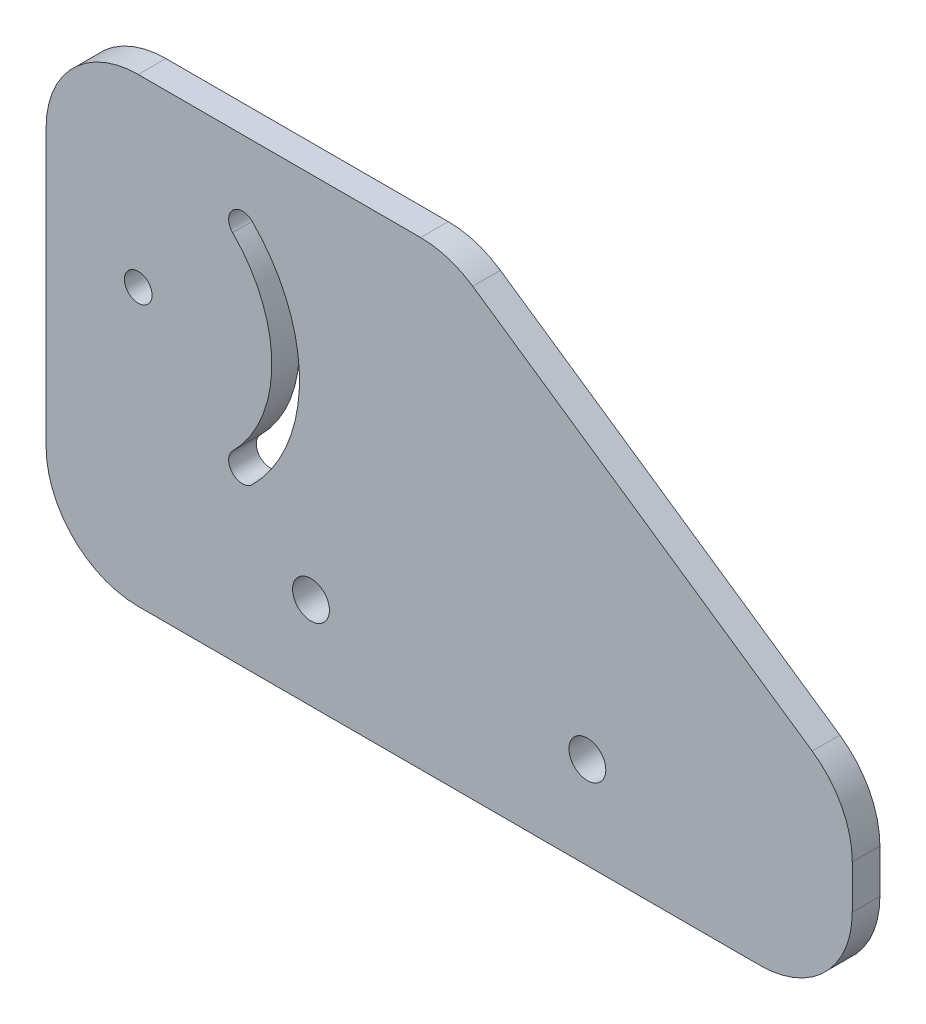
ISO-10303-21;
HEADER;
FILE_DESCRIPTION(('STEP AP214'),'2;1');
FILE_NAME('part.step','',(''),(''),'','','');
FILE_SCHEMA(('AUTOMOTIVE_DESIGN { 1 0 10303 214 1 1 1 1 }'));
ENDSEC;
DATA;
#1=APPLICATION_CONTEXT('core data for automotive mechanical design processes');
#2=APPLICATION_PROTOCOL_DEFINITION('international standard','automotive_design',2000,#1);
#3=PRODUCT_CONTEXT('',#1,'mechanical');
#4=PRODUCT('Part','Part','',(#3));
#5=PRODUCT_RELATED_PRODUCT_CATEGORY('part','',(#4));
#6=PRODUCT_DEFINITION_FORMATION('','',#4);
#7=PRODUCT_DEFINITION_CONTEXT('part definition',#1,'design');
#8=PRODUCT_DEFINITION('design','',#6,#7);
#9=PRODUCT_DEFINITION_SHAPE('','',#8);
#10=(LENGTH_UNIT() NAMED_UNIT(*) SI_UNIT(.MILLI.,.METRE.));
#11=(NAMED_UNIT(*) PLANE_ANGLE_UNIT() SI_UNIT($,.RADIAN.));
#12=(NAMED_UNIT(*) SI_UNIT($,.STERADIAN.) SOLID_ANGLE_UNIT());
#13=UNCERTAINTY_MEASURE_WITH_UNIT(LENGTH_MEASURE(1.E-05),#10,'distance_accuracy_value','');
#14=(GEOMETRIC_REPRESENTATION_CONTEXT(3) GLOBAL_UNCERTAINTY_ASSIGNED_CONTEXT((#13)) GLOBAL_UNIT_ASSIGNED_CONTEXT((#10,
#11,#12)) REPRESENTATION_CONTEXT('',''));
#15=CARTESIAN_POINT('',(0.,0.,0.));
#16=DIRECTION('',(0.,0.,1.));
#17=DIRECTION('',(1.,0.,0.));
#18=AXIS2_PLACEMENT_3D('',#15,#16,#17);
#19=CARTESIAN_POINT('',(43.75,25.,3.));
#20=DIRECTION('',(-1.,0.,0.));
#21=DIRECTION('',(0.,-1.,0.));
#22=AXIS2_PLACEMENT_3D('',#19,#20,#21);
#23=PLANE('',#22);
#24=DIRECTION('',(0.,1.,0.));
#25=VECTOR('',#24,1.);
#26=CARTESIAN_POINT('',(43.75,25.,0.));
#27=LINE('',#26,#25);
#28=CARTESIAN_POINT('',(43.75,-15.,0.));
#29=VERTEX_POINT('',#28);
#30=CARTESIAN_POINT('',(43.75,-10.2680543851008,0.));
#31=VERTEX_POINT('',#30);
#32=EDGE_CURVE('E191',#29,#31,#27,.T.);
#33=ORIENTED_EDGE('',*,*,#32,.T.);
#34=DIRECTION('',(0.,0.,1.));
#35=VECTOR('',#34,1.);
#36=CARTESIAN_POINT('',(43.75,-10.2680543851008,3.));
#37=LINE('',#36,#35);
#38=CARTESIAN_POINT('',(43.75,-10.2680543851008,3.));
#39=VERTEX_POINT('',#38);
#40=EDGE_CURVE('E258',#31,#39,#37,.T.);
#41=ORIENTED_EDGE('',*,*,#40,.T.);
#42=DIRECTION('',(0.,1.,0.));
#43=VECTOR('',#42,1.);
#44=CARTESIAN_POINT('',(43.75,25.,3.));
#45=LINE('',#44,#43);
#46=CARTESIAN_POINT('',(43.75,-15.,3.));
#47=VERTEX_POINT('',#46);
#48=EDGE_CURVE('E192',#47,#39,#45,.T.);
#49=ORIENTED_EDGE('',*,*,#48,.F.);
#50=DIRECTION('',(0.,0.,-1.));
#51=VECTOR('',#50,1.);
#52=CARTESIAN_POINT('',(43.75,-15.,3.));
#53=LINE('',#52,#51);
#54=EDGE_CURVE('E255',#47,#29,#53,.T.);
#55=ORIENTED_EDGE('',*,*,#54,.T.);
#56=EDGE_LOOP('',(#33,#41,#49,#55));
#57=FACE_BOUND('',#56,.T.);
#58=ADVANCED_FACE('F35',(#57),#23,.F.);
#59=CARTESIAN_POINT('',(-43.75,25.,3.));
#60=DIRECTION('',(0.,-1.,0.));
#61=DIRECTION('',(0.,0.,-1.));
#62=AXIS2_PLACEMENT_3D('',#59,#60,#61);
#63=PLANE('',#62);
#64=DIRECTION('',(-1.,0.,0.));
#65=VECTOR('',#64,1.);
#66=CARTESIAN_POINT('',(-43.75,25.,3.));
#67=LINE('',#66,#65);
#68=CARTESIAN_POINT('',(-3.09924597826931,25.,3.));
#69=VERTEX_POINT('',#68);
#70=CARTESIAN_POINT('',(-33.75,25.,3.));
#71=VERTEX_POINT('',#70);
#72=EDGE_CURVE('E195',#69,#71,#67,.T.);
#73=ORIENTED_EDGE('',*,*,#72,.F.);
#74=DIRECTION('',(0.,0.,1.));
#75=VECTOR('',#74,1.);
#76=CARTESIAN_POINT('',(-3.09924597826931,25.,3.));
#77=LINE('',#76,#75);
#78=CARTESIAN_POINT('',(-3.09924597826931,25.,0.));
#79=VERTEX_POINT('',#78);
#80=EDGE_CURVE('E245',#69,#79,#77,.F.);
#81=ORIENTED_EDGE('',*,*,#80,.T.);
#82=DIRECTION('',(-1.,0.,0.));
#83=VECTOR('',#82,1.);
#84=CARTESIAN_POINT('',(-43.75,25.,0.));
#85=LINE('',#84,#83);
#86=CARTESIAN_POINT('',(-33.75,25.,0.));
#87=VERTEX_POINT('',#86);
#88=EDGE_CURVE('E208',#79,#87,#85,.T.);
#89=ORIENTED_EDGE('',*,*,#88,.T.);
#90=DIRECTION('',(0.,0.,-1.));
#91=VECTOR('',#90,1.);
#92=CARTESIAN_POINT('',(-33.75,25.,3.));
#93=LINE('',#92,#91);
#94=EDGE_CURVE('E243',#87,#71,#93,.F.);
#95=ORIENTED_EDGE('',*,*,#94,.T.);
#96=EDGE_LOOP('',(#73,#81,#89,#95));
#97=FACE_BOUND('',#96,.T.);
#98=ADVANCED_FACE('F275',(#97),#63,.F.);
#99=CARTESIAN_POINT('',(-43.75,25.,3.));
#100=DIRECTION('',(1.,0.,0.));
#101=DIRECTION('',(0.,1.,0.));
#102=AXIS2_PLACEMENT_3D('',#99,#100,#101);
#103=PLANE('',#102);
#104=DIRECTION('',(0.,-1.,0.));
#105=VECTOR('',#104,1.);
#106=CARTESIAN_POINT('',(-43.75,25.,0.));
#107=LINE('',#106,#105);
#108=CARTESIAN_POINT('',(-43.75,15.,0.));
#109=VERTEX_POINT('',#108);
#110=CARTESIAN_POINT('',(-43.75,-15.,0.));
#111=VERTEX_POINT('',#110);
#112=EDGE_CURVE('E211',#109,#111,#107,.T.);
#113=ORIENTED_EDGE('',*,*,#112,.T.);
#114=DIRECTION('',(0.,0.,-1.));
#115=VECTOR('',#114,1.);
#116=CARTESIAN_POINT('',(-43.75,-15.,3.));
#117=LINE('',#116,#115);
#118=CARTESIAN_POINT('',(-43.75,-15.,3.));
#119=VERTEX_POINT('',#118);
#120=EDGE_CURVE('E11',#111,#119,#117,.F.);
#121=ORIENTED_EDGE('',*,*,#120,.T.);
#122=DIRECTION('',(0.,-1.,0.));
#123=VECTOR('',#122,1.);
#124=CARTESIAN_POINT('',(-43.75,25.,3.));
#125=LINE('',#124,#123);
#126=CARTESIAN_POINT('',(-43.75,15.,3.));
#127=VERTEX_POINT('',#126);
#128=EDGE_CURVE('E199',#127,#119,#125,.T.);
#129=ORIENTED_EDGE('',*,*,#128,.F.);
#130=DIRECTION('',(0.,0.,-1.));
#131=VECTOR('',#130,1.);
#132=CARTESIAN_POINT('',(-43.75,15.,3.));
#133=LINE('',#132,#131);
#134=EDGE_CURVE('E43',#127,#109,#133,.T.);
#135=ORIENTED_EDGE('',*,*,#134,.T.);
#136=EDGE_LOOP('',(#113,#121,#129,#135));
#137=FACE_BOUND('',#136,.T.);
#138=ADVANCED_FACE('F267',(#137),#103,.F.);
#139=CARTESIAN_POINT('',(-43.75,-25.,3.));
#140=DIRECTION('',(0.,1.,0.));
#141=DIRECTION('',(0.,0.,1.));
#142=AXIS2_PLACEMENT_3D('',#139,#140,#141);
#143=PLANE('',#142);
#144=DIRECTION('',(1.,0.,0.));
#145=VECTOR('',#144,1.);
#146=CARTESIAN_POINT('',(-43.75,-25.,0.));
#147=LINE('',#146,#145);
#148=CARTESIAN_POINT('',(-33.75,-25.,0.));
#149=VERTEX_POINT('',#148);
#150=CARTESIAN_POINT('',(33.75,-25.,0.));
#151=VERTEX_POINT('',#150);
#152=EDGE_CURVE('E196',#149,#151,#147,.T.);
#153=ORIENTED_EDGE('',*,*,#152,.T.);
#154=DIRECTION('',(0.,0.,-1.));
#155=VECTOR('',#154,1.);
#156=CARTESIAN_POINT('',(33.75,-25.,3.));
#157=LINE('',#156,#155);
#158=CARTESIAN_POINT('',(33.75,-25.,3.));
#159=VERTEX_POINT('',#158);
#160=EDGE_CURVE('E264',#151,#159,#157,.F.);
#161=ORIENTED_EDGE('',*,*,#160,.T.);
#162=DIRECTION('',(1.,0.,0.));
#163=VECTOR('',#162,1.);
#164=CARTESIAN_POINT('',(-43.75,-25.,3.));
#165=LINE('',#164,#163);
#166=CARTESIAN_POINT('',(-33.75,-25.,3.));
#167=VERTEX_POINT('',#166);
#168=EDGE_CURVE('E202',#167,#159,#165,.T.);
#169=ORIENTED_EDGE('',*,*,#168,.F.);
#170=DIRECTION('',(0.,0.,-1.));
#171=VECTOR('',#170,1.);
#172=CARTESIAN_POINT('',(-33.75,-25.,3.));
#173=LINE('',#172,#171);
#174=EDGE_CURVE('E261',#167,#149,#173,.T.);
#175=ORIENTED_EDGE('',*,*,#174,.T.);
#176=EDGE_LOOP('',(#153,#161,#169,#175));
#177=FACE_BOUND('',#176,.T.);
#178=ADVANCED_FACE('F301',(#177),#143,.F.);
#179=CARTESIAN_POINT('',(0.,0.,3.));
#180=DIRECTION('',(0.,0.,1.));
#181=DIRECTION('',(1.,0.,0.));
#182=AXIS2_PLACEMENT_3D('',#179,#180,#181);
#183=PLANE('',#182);
#184=CARTESIAN_POINT('',(-22.4362915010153,-6.31370849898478,3.));
#185=DIRECTION('',(0.,0.,1.));
#186=DIRECTION('',(1.,0.,0.));
#187=AXIS2_PLACEMENT_3D('',#184,#185,#186);
#188=CIRCLE('',#187,1.5);
#189=CARTESIAN_POINT('',(-23.4969516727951,-5.25304832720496,3.));
#190=VERTEX_POINT('',#189);
#191=CARTESIAN_POINT('',(-21.3756313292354,-7.3743686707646,3.));
#192=VERTEX_POINT('',#191);
#193=EDGE_CURVE('E158',#190,#192,#188,.T.);
#194=ORIENTED_EDGE('',*,*,#193,.F.);
#195=CARTESIAN_POINT('',(-33.75,5.,3.));
#196=DIRECTION('',(0.,0.,-1.));
#197=DIRECTION('',(1.,0.,0.));
#198=AXIS2_PLACEMENT_3D('',#195,#196,#197);
#199=CIRCLE('',#198,14.5);
#200=CARTESIAN_POINT('',(-23.4969516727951,15.2530483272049,3.));
#201=VERTEX_POINT('',#200);
#202=EDGE_CURVE('E163',#201,#190,#199,.T.);
#203=ORIENTED_EDGE('',*,*,#202,.F.);
#204=CARTESIAN_POINT('',(-22.4362915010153,16.3137084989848,3.));
#205=DIRECTION('',(0.,0.,1.));
#206=DIRECTION('',(1.,0.,0.));
#207=AXIS2_PLACEMENT_3D('',#204,#205,#206);
#208=CIRCLE('',#207,1.5);
#209=CARTESIAN_POINT('',(-21.3756313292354,17.3743686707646,3.));
#210=VERTEX_POINT('',#209);
#211=EDGE_CURVE('E142',#210,#201,#208,.T.);
#212=ORIENTED_EDGE('',*,*,#211,.F.);
#213=CARTESIAN_POINT('',(-33.75,5.,3.));
#214=DIRECTION('',(0.,0.,1.));
#215=DIRECTION('',(1.,0.,0.));
#216=AXIS2_PLACEMENT_3D('',#213,#214,#215);
#217=CIRCLE('',#216,17.5);
#218=EDGE_CURVE('E153',#192,#210,#217,.T.);
#219=ORIENTED_EDGE('',*,*,#218,.F.);
#220=EDGE_LOOP('',(#194,#203,#212,#219));
#221=FACE_BOUND('',#220,.T.);
#222=CARTESIAN_POINT('',(-33.75,5.,3.));
#223=DIRECTION('',(0.,0.,1.));
#224=DIRECTION('',(1.,0.,0.));
#225=AXIS2_PLACEMENT_3D('',#222,#223,#224);
#226=CIRCLE('',#225,1.5);
#227=CARTESIAN_POINT('',(-32.25,5.,3.));
#228=VERTEX_POINT('',#227);
#229=EDGE_CURVE('E170',#228,#228,#226,.T.);
#230=ORIENTED_EDGE('',*,*,#229,.F.);
#231=EDGE_LOOP('',(#230));
#232=FACE_BOUND('',#231,.T.);
#233=DIRECTION('',(0.824728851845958,-0.565528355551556,0.));
#234=VECTOR('',#233,1.);
#235=CARTESIAN_POINT('',(43.7499999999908,-4.99999999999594,3.));
#236=LINE('',#235,#234);
#237=CARTESIAN_POINT('',(2.55603757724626,23.2472885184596,3.));
#238=VERTEX_POINT('',#237);
#239=CARTESIAN_POINT('',(39.4052835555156,-2.02076586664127,3.));
#240=VERTEX_POINT('',#239);
#241=EDGE_CURVE('E176',#238,#240,#236,.T.);
#242=ORIENTED_EDGE('',*,*,#241,.F.);
#243=CARTESIAN_POINT('',(-3.09924597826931,15.,3.));
#244=DIRECTION('',(0.,0.,1.));
#245=DIRECTION('',(1.,0.,0.));
#246=AXIS2_PLACEMENT_3D('',#243,#244,#245);
#247=CIRCLE('',#246,10.);
#248=EDGE_CURVE('E241',#238,#69,#247,.T.);
#249=ORIENTED_EDGE('',*,*,#248,.T.);
#250=ORIENTED_EDGE('',*,*,#72,.T.);
#251=CARTESIAN_POINT('',(-33.75,15.,3.));
#252=DIRECTION('',(0.,0.,1.));
#253=DIRECTION('',(1.,0.,0.));
#254=AXIS2_PLACEMENT_3D('',#251,#252,#253);
#255=CIRCLE('',#254,10.);
#256=EDGE_CURVE('E233',#71,#127,#255,.T.);
#257=ORIENTED_EDGE('',*,*,#256,.T.);
#258=ORIENTED_EDGE('',*,*,#128,.T.);
#259=CARTESIAN_POINT('',(-33.75,-15.,3.));
#260=DIRECTION('',(0.,0.,1.));
#261=DIRECTION('',(1.,0.,0.));
#262=AXIS2_PLACEMENT_3D('',#259,#260,#261);
#263=CIRCLE('',#262,10.);
#264=EDGE_CURVE('E235',#119,#167,#263,.T.);
#265=ORIENTED_EDGE('',*,*,#264,.T.);
#266=ORIENTED_EDGE('',*,*,#168,.T.);
#267=CARTESIAN_POINT('',(33.75,-15.,3.));
#268=DIRECTION('',(0.,0.,1.));
#269=DIRECTION('',(1.,0.,0.));
#270=AXIS2_PLACEMENT_3D('',#267,#268,#269);
#271=CIRCLE('',#270,10.);
#272=EDGE_CURVE('E237',#159,#47,#271,.T.);
#273=ORIENTED_EDGE('',*,*,#272,.T.);
#274=ORIENTED_EDGE('',*,*,#48,.T.);
#275=CARTESIAN_POINT('',(33.75,-10.2680543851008,3.));
#276=DIRECTION('',(0.,0.,1.));
#277=DIRECTION('',(1.,0.,0.));
#278=AXIS2_PLACEMENT_3D('',#275,#276,#277);
#279=CIRCLE('',#278,10.);
#280=EDGE_CURVE('E239',#39,#240,#279,.T.);
#281=ORIENTED_EDGE('',*,*,#280,.T.);
#282=EDGE_LOOP('',(#242,#249,#250,#257,#258,#265,#266,#273,#274,#281));
#283=FACE_BOUND('',#282,.T.);
#284=CARTESIAN_POINT('',(-15.,-15.,3.));
#285=DIRECTION('',(0.,0.,1.));
#286=DIRECTION('',(1.,0.,0.));
#287=AXIS2_PLACEMENT_3D('',#284,#285,#286);
#288=CIRCLE('',#287,1.99999999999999);
#289=CARTESIAN_POINT('',(-13.,-15.,3.));
#290=VERTEX_POINT('',#289);
#291=EDGE_CURVE('E179',#290,#290,#288,.T.);
#292=ORIENTED_EDGE('',*,*,#291,.F.);
#293=EDGE_LOOP('',(#292));
#294=FACE_BOUND('',#293,.T.);
#295=CARTESIAN_POINT('',(15.,-15.,3.));
#296=DIRECTION('',(0.,0.,1.));
#297=DIRECTION('',(1.,0.,0.));
#298=AXIS2_PLACEMENT_3D('',#295,#296,#297);
#299=CIRCLE('',#298,1.99999999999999);
#300=CARTESIAN_POINT('',(17.,-15.,3.));
#301=VERTEX_POINT('',#300);
#302=EDGE_CURVE('E185',#301,#301,#299,.T.);
#303=ORIENTED_EDGE('',*,*,#302,.F.);
#304=EDGE_LOOP('',(#303));
#305=FACE_BOUND('',#304,.T.);
#306=ADVANCED_FACE('F160',(#221,#232,#283,#294,#305),#183,.T.);
#307=CARTESIAN_POINT('',(0.,0.,0.));
#308=DIRECTION('',(0.,0.,1.));
#309=DIRECTION('',(1.,0.,0.));
#310=AXIS2_PLACEMENT_3D('',#307,#308,#309);
#311=PLANE('',#310);
#312=CARTESIAN_POINT('',(-33.75,5.,0.));
#313=DIRECTION('',(0.,0.,1.));
#314=DIRECTION('',(1.,0.,0.));
#315=AXIS2_PLACEMENT_3D('',#312,#313,#314);
#316=CIRCLE('',#315,14.5);
#317=CARTESIAN_POINT('',(-23.4969516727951,15.2530483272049,0.));
#318=VERTEX_POINT('',#317);
#319=CARTESIAN_POINT('',(-23.4969516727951,-5.25304832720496,0.));
#320=VERTEX_POINT('',#319);
#321=EDGE_CURVE('E222',#318,#320,#316,.F.);
#322=ORIENTED_EDGE('',*,*,#321,.T.);
#323=CARTESIAN_POINT('',(-22.4362915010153,-6.31370849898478,0.));
#324=DIRECTION('',(0.,0.,1.));
#325=DIRECTION('',(1.,0.,0.));
#326=AXIS2_PLACEMENT_3D('',#323,#324,#325);
#327=CIRCLE('',#326,1.5);
#328=CARTESIAN_POINT('',(-21.3756313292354,-7.3743686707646,0.));
#329=VERTEX_POINT('',#328);
#330=EDGE_CURVE('E225',#320,#329,#327,.T.);
#331=ORIENTED_EDGE('',*,*,#330,.T.);
#332=CARTESIAN_POINT('',(-33.75,5.,0.));
#333=DIRECTION('',(0.,0.,1.));
#334=DIRECTION('',(1.,0.,0.));
#335=AXIS2_PLACEMENT_3D('',#332,#333,#334);
#336=CIRCLE('',#335,17.5);
#337=CARTESIAN_POINT('',(-21.3756313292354,17.3743686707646,0.));
#338=VERTEX_POINT('',#337);
#339=EDGE_CURVE('E217',#329,#338,#336,.T.);
#340=ORIENTED_EDGE('',*,*,#339,.T.);
#341=CARTESIAN_POINT('',(-22.4362915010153,16.3137084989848,0.));
#342=DIRECTION('',(0.,0.,1.));
#343=DIRECTION('',(1.,0.,0.));
#344=AXIS2_PLACEMENT_3D('',#341,#342,#343);
#345=CIRCLE('',#344,1.5);
#346=EDGE_CURVE('E145',#338,#318,#345,.T.);
#347=ORIENTED_EDGE('',*,*,#346,.T.);
#348=EDGE_LOOP('',(#322,#331,#340,#347));
#349=FACE_BOUND('',#348,.T.);
#350=CARTESIAN_POINT('',(-33.75,5.,0.));
#351=DIRECTION('',(0.,0.,1.));
#352=DIRECTION('',(1.,0.,0.));
#353=AXIS2_PLACEMENT_3D('',#350,#351,#352);
#354=CIRCLE('',#353,1.5);
#355=CARTESIAN_POINT('',(-32.25,5.,0.));
#356=VERTEX_POINT('',#355);
#357=EDGE_CURVE('E175',#356,#356,#354,.T.);
#358=ORIENTED_EDGE('',*,*,#357,.T.);
#359=EDGE_LOOP('',(#358));
#360=FACE_BOUND('',#359,.T.);
#361=CARTESIAN_POINT('',(-15.,-15.,0.));
#362=DIRECTION('',(0.,0.,1.));
#363=DIRECTION('',(1.,0.,0.));
#364=AXIS2_PLACEMENT_3D('',#361,#362,#363);
#365=CIRCLE('',#364,2.);
#366=CARTESIAN_POINT('',(-13.,-15.,0.));
#367=VERTEX_POINT('',#366);
#368=EDGE_CURVE('E182',#367,#367,#365,.T.);
#369=ORIENTED_EDGE('',*,*,#368,.T.);
#370=EDGE_LOOP('',(#369));
#371=FACE_BOUND('',#370,.T.);
#372=CARTESIAN_POINT('',(15.,-15.,0.));
#373=DIRECTION('',(0.,0.,1.));
#374=DIRECTION('',(1.,0.,0.));
#375=AXIS2_PLACEMENT_3D('',#372,#373,#374);
#376=CIRCLE('',#375,2.);
#377=CARTESIAN_POINT('',(17.,-15.,0.));
#378=VERTEX_POINT('',#377);
#379=EDGE_CURVE('E188',#378,#378,#376,.T.);
#380=ORIENTED_EDGE('',*,*,#379,.T.);
#381=EDGE_LOOP('',(#380));
#382=FACE_BOUND('',#381,.T.);
#383=ORIENTED_EDGE('',*,*,#88,.F.);
#384=CARTESIAN_POINT('',(-3.09924597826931,15.,0.));
#385=DIRECTION('',(0.,0.,1.));
#386=DIRECTION('',(1.,0.,0.));
#387=AXIS2_PLACEMENT_3D('',#384,#385,#386);
#388=CIRCLE('',#387,10.);
#389=CARTESIAN_POINT('',(2.55603757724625,23.2472885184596,0.));
#390=VERTEX_POINT('',#389);
#391=EDGE_CURVE('E253',#79,#390,#388,.F.);
#392=ORIENTED_EDGE('',*,*,#391,.T.);
#393=DIRECTION('',(0.824728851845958,-0.565528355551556,0.));
#394=VECTOR('',#393,1.);
#395=CARTESIAN_POINT('',(11.6601887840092,17.0044419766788,0.));
#396=LINE('',#395,#394);
#397=CARTESIAN_POINT('',(39.4052835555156,-2.02076586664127,0.));
#398=VERTEX_POINT('',#397);
#399=EDGE_CURVE('E205',#390,#398,#396,.T.);
#400=ORIENTED_EDGE('',*,*,#399,.T.);
#401=CARTESIAN_POINT('',(33.75,-10.2680543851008,0.));
#402=DIRECTION('',(0.,0.,1.));
#403=DIRECTION('',(1.,0.,0.));
#404=AXIS2_PLACEMENT_3D('',#401,#402,#403);
#405=CIRCLE('',#404,10.);
#406=EDGE_CURVE('E251',#398,#31,#405,.F.);
#407=ORIENTED_EDGE('',*,*,#406,.T.);
#408=ORIENTED_EDGE('',*,*,#32,.F.);
#409=CARTESIAN_POINT('',(33.75,-15.,0.));
#410=DIRECTION('',(0.,0.,1.));
#411=DIRECTION('',(1.,0.,0.));
#412=AXIS2_PLACEMENT_3D('',#409,#410,#411);
#413=CIRCLE('',#412,10.);
#414=EDGE_CURVE('E249',#29,#151,#413,.F.);
#415=ORIENTED_EDGE('',*,*,#414,.T.);
#416=ORIENTED_EDGE('',*,*,#152,.F.);
#417=CARTESIAN_POINT('',(-33.75,-15.,0.));
#418=DIRECTION('',(0.,0.,1.));
#419=DIRECTION('',(1.,0.,0.));
#420=AXIS2_PLACEMENT_3D('',#417,#418,#419);
#421=CIRCLE('',#420,10.);
#422=EDGE_CURVE('E50',#149,#111,#421,.F.);
#423=ORIENTED_EDGE('',*,*,#422,.T.);
#424=ORIENTED_EDGE('',*,*,#112,.F.);
#425=CARTESIAN_POINT('',(-33.75,15.,0.));
#426=DIRECTION('',(0.,0.,1.));
#427=DIRECTION('',(1.,0.,0.));
#428=AXIS2_PLACEMENT_3D('',#425,#426,#427);
#429=CIRCLE('',#428,10.);
#430=EDGE_CURVE('E58',#109,#87,#429,.F.);
#431=ORIENTED_EDGE('',*,*,#430,.T.);
#432=EDGE_LOOP('',(#383,#392,#400,#407,#408,#415,#416,#423,#424,#431));
#433=FACE_BOUND('',#432,.T.);
#434=ADVANCED_FACE('F271',(#349,#360,#371,#382,#433),#311,.F.);
#435=CARTESIAN_POINT('',(15.,-15.,3.));
#436=DIRECTION('',(0.,0.,1.));
#437=DIRECTION('',(1.,0.,0.));
#438=AXIS2_PLACEMENT_3D('',#435,#436,#437);
#439=CYLINDRICAL_SURFACE('',#438,1.99999999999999);
#440=ORIENTED_EDGE('',*,*,#379,.F.);
#441=EDGE_LOOP('',(#440));
#442=FACE_BOUND('',#441,.T.);
#443=ORIENTED_EDGE('',*,*,#302,.T.);
#444=EDGE_LOOP('',(#443));
#445=FACE_BOUND('',#444,.T.);
#446=ADVANCED_FACE('F406',(#442,#445),#439,.F.);
#447=CARTESIAN_POINT('',(-15.,-15.,3.));
#448=DIRECTION('',(0.,0.,1.));
#449=DIRECTION('',(1.,0.,0.));
#450=AXIS2_PLACEMENT_3D('',#447,#448,#449);
#451=CYLINDRICAL_SURFACE('',#450,1.99999999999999);
#452=ORIENTED_EDGE('',*,*,#368,.F.);
#453=EDGE_LOOP('',(#452));
#454=FACE_BOUND('',#453,.T.);
#455=ORIENTED_EDGE('',*,*,#291,.T.);
#456=EDGE_LOOP('',(#455));
#457=FACE_BOUND('',#456,.T.);
#458=ADVANCED_FACE('F399',(#454,#457),#451,.F.);
#459=CARTESIAN_POINT('',(43.7499999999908,-4.99999999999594,-7.));
#460=DIRECTION('',(-0.565528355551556,-0.824728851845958,0.));
#461=DIRECTION('',(0.824728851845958,-0.565528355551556,0.));
#462=AXIS2_PLACEMENT_3D('',#459,#460,#461);
#463=PLANE('',#462);
#464=ORIENTED_EDGE('',*,*,#399,.F.);
#465=DIRECTION('',(0.,0.,1.));
#466=VECTOR('',#465,1.);
#467=CARTESIAN_POINT('',(2.55603757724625,23.2472885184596,-7.));
#468=LINE('',#467,#466);
#469=EDGE_CURVE('E230',#390,#238,#468,.T.);
#470=ORIENTED_EDGE('',*,*,#469,.T.);
#471=ORIENTED_EDGE('',*,*,#241,.T.);
#472=DIRECTION('',(0.,0.,1.));
#473=VECTOR('',#472,1.);
#474=CARTESIAN_POINT('',(39.4052835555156,-2.02076586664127,-7.));
#475=LINE('',#474,#473);
#476=EDGE_CURVE('E228',#240,#398,#475,.F.);
#477=ORIENTED_EDGE('',*,*,#476,.T.);
#478=EDGE_LOOP('',(#464,#470,#471,#477));
#479=FACE_BOUND('',#478,.T.);
#480=ADVANCED_FACE('F287',(#479),#463,.F.);
#481=CARTESIAN_POINT('',(-33.75,5.,-21.));
#482=DIRECTION('',(0.,0.,1.));
#483=DIRECTION('',(1.,0.,0.));
#484=AXIS2_PLACEMENT_3D('',#481,#482,#483);
#485=CYLINDRICAL_SURFACE('',#484,1.5);
#486=ORIENTED_EDGE('',*,*,#229,.T.);
#487=EDGE_LOOP('',(#486));
#488=FACE_BOUND('',#487,.T.);
#489=ORIENTED_EDGE('',*,*,#357,.F.);
#490=EDGE_LOOP('',(#489));
#491=FACE_BOUND('',#490,.T.);
#492=ADVANCED_FACE('F382',(#488,#491),#485,.F.);
#493=CARTESIAN_POINT('',(-22.4362915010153,-6.31370849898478,-21.));
#494=DIRECTION('',(0.,0.,1.));
#495=DIRECTION('',(1.,0.,0.));
#496=AXIS2_PLACEMENT_3D('',#493,#494,#495);
#497=CYLINDRICAL_SURFACE('',#496,1.5);
#498=DIRECTION('',(0.,0.,1.));
#499=VECTOR('',#498,1.);
#500=CARTESIAN_POINT('',(-23.4969516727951,-5.25304832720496,-21.));
#501=LINE('',#500,#499);
#502=EDGE_CURVE('E168',#320,#190,#501,.T.);
#503=ORIENTED_EDGE('',*,*,#502,.T.);
#504=ORIENTED_EDGE('',*,*,#193,.T.);
#505=DIRECTION('',(0.,0.,1.));
#506=VECTOR('',#505,1.);
#507=CARTESIAN_POINT('',(-21.3756313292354,-7.3743686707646,-21.));
#508=LINE('',#507,#506);
#509=EDGE_CURVE('E149',#329,#192,#508,.T.);
#510=ORIENTED_EDGE('',*,*,#509,.F.);
#511=ORIENTED_EDGE('',*,*,#330,.F.);
#512=EDGE_LOOP('',(#503,#504,#510,#511));
#513=FACE_BOUND('',#512,.T.);
#514=ADVANCED_FACE('F373',(#513),#497,.F.);
#515=CARTESIAN_POINT('',(-33.75,5.,-21.));
#516=DIRECTION('',(0.,0.,1.));
#517=DIRECTION('',(1.,0.,0.));
#518=AXIS2_PLACEMENT_3D('',#515,#516,#517);
#519=CYLINDRICAL_SURFACE('',#518,14.5);
#520=DIRECTION('',(0.,0.,1.));
#521=VECTOR('',#520,1.);
#522=CARTESIAN_POINT('',(-23.4969516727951,15.2530483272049,-21.));
#523=LINE('',#522,#521);
#524=EDGE_CURVE('E148',#318,#201,#523,.T.);
#525=ORIENTED_EDGE('',*,*,#524,.T.);
#526=ORIENTED_EDGE('',*,*,#202,.T.);
#527=ORIENTED_EDGE('',*,*,#502,.F.);
#528=ORIENTED_EDGE('',*,*,#321,.F.);
#529=EDGE_LOOP('',(#525,#526,#527,#528));
#530=FACE_BOUND('',#529,.T.);
#531=ADVANCED_FACE('F365',(#530),#519,.T.);
#532=CARTESIAN_POINT('',(-22.4362915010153,16.3137084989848,-21.));
#533=DIRECTION('',(0.,0.,1.));
#534=DIRECTION('',(1.,0.,0.));
#535=AXIS2_PLACEMENT_3D('',#532,#533,#534);
#536=CYLINDRICAL_SURFACE('',#535,1.5);
#537=DIRECTION('',(0.,0.,1.));
#538=VECTOR('',#537,1.);
#539=CARTESIAN_POINT('',(-21.3756313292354,17.3743686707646,-21.));
#540=LINE('',#539,#538);
#541=EDGE_CURVE('E137',#338,#210,#540,.T.);
#542=ORIENTED_EDGE('',*,*,#541,.T.);
#543=ORIENTED_EDGE('',*,*,#211,.T.);
#544=ORIENTED_EDGE('',*,*,#524,.F.);
#545=ORIENTED_EDGE('',*,*,#346,.F.);
#546=EDGE_LOOP('',(#542,#543,#544,#545));
#547=FACE_BOUND('',#546,.T.);
#548=ADVANCED_FACE('F139',(#547),#536,.F.);
#549=CARTESIAN_POINT('',(-33.75,5.,-21.));
#550=DIRECTION('',(0.,0.,1.));
#551=DIRECTION('',(1.,0.,0.));
#552=AXIS2_PLACEMENT_3D('',#549,#550,#551);
#553=CYLINDRICAL_SURFACE('',#552,17.5);
#554=ORIENTED_EDGE('',*,*,#509,.T.);
#555=ORIENTED_EDGE('',*,*,#218,.T.);
#556=ORIENTED_EDGE('',*,*,#541,.F.);
#557=ORIENTED_EDGE('',*,*,#339,.F.);
#558=EDGE_LOOP('',(#554,#555,#556,#557));
#559=FACE_BOUND('',#558,.T.);
#560=ADVANCED_FACE('F154',(#559),#553,.F.);
#561=CARTESIAN_POINT('',(-3.09924597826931,15.,-7.));
#562=DIRECTION('',(0.,0.,1.));
#563=DIRECTION('',(1.,0.,0.));
#564=AXIS2_PLACEMENT_3D('',#561,#562,#563);
#565=CYLINDRICAL_SURFACE('',#564,10.);
#566=ORIENTED_EDGE('',*,*,#391,.F.);
#567=ORIENTED_EDGE('',*,*,#80,.F.);
#568=ORIENTED_EDGE('',*,*,#248,.F.);
#569=ORIENTED_EDGE('',*,*,#469,.F.);
#570=EDGE_LOOP('',(#566,#567,#568,#569));
#571=FACE_BOUND('',#570,.T.);
#572=ADVANCED_FACE('F282',(#571),#565,.T.);
#573=CARTESIAN_POINT('',(33.75,-10.2680543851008,3.));
#574=DIRECTION('',(0.,0.,1.));
#575=DIRECTION('',(1.,0.,0.));
#576=AXIS2_PLACEMENT_3D('',#573,#574,#575);
#577=CYLINDRICAL_SURFACE('',#576,10.);
#578=ORIENTED_EDGE('',*,*,#406,.F.);
#579=ORIENTED_EDGE('',*,*,#476,.F.);
#580=ORIENTED_EDGE('',*,*,#280,.F.);
#581=ORIENTED_EDGE('',*,*,#40,.F.);
#582=EDGE_LOOP('',(#578,#579,#580,#581));
#583=FACE_BOUND('',#582,.T.);
#584=ADVANCED_FACE('F290',(#583),#577,.T.);
#585=CARTESIAN_POINT('',(33.75,-15.,3.));
#586=DIRECTION('',(0.,0.,-1.));
#587=DIRECTION('',(-1.,0.,0.));
#588=AXIS2_PLACEMENT_3D('',#585,#586,#587);
#589=CYLINDRICAL_SURFACE('',#588,10.);
#590=ORIENTED_EDGE('',*,*,#272,.F.);
#591=ORIENTED_EDGE('',*,*,#160,.F.);
#592=ORIENTED_EDGE('',*,*,#414,.F.);
#593=ORIENTED_EDGE('',*,*,#54,.F.);
#594=EDGE_LOOP('',(#590,#591,#592,#593));
#595=FACE_BOUND('',#594,.T.);
#596=ADVANCED_FACE('F298',(#595),#589,.T.);
#597=CARTESIAN_POINT('',(-33.75,-15.,3.));
#598=DIRECTION('',(0.,0.,-1.));
#599=DIRECTION('',(-1.,0.,0.));
#600=AXIS2_PLACEMENT_3D('',#597,#598,#599);
#601=CYLINDRICAL_SURFACE('',#600,10.);
#602=ORIENTED_EDGE('',*,*,#264,.F.);
#603=ORIENTED_EDGE('',*,*,#120,.F.);
#604=ORIENTED_EDGE('',*,*,#422,.F.);
#605=ORIENTED_EDGE('',*,*,#174,.F.);
#606=EDGE_LOOP('',(#602,#603,#604,#605));
#607=FACE_BOUND('',#606,.T.);
#608=ADVANCED_FACE('F305',(#607),#601,.T.);
#609=CARTESIAN_POINT('',(-33.75,15.,3.));
#610=DIRECTION('',(0.,0.,-1.));
#611=DIRECTION('',(-1.,0.,0.));
#612=AXIS2_PLACEMENT_3D('',#609,#610,#611);
#613=CYLINDRICAL_SURFACE('',#612,10.);
#614=ORIENTED_EDGE('',*,*,#256,.F.);
#615=ORIENTED_EDGE('',*,*,#94,.F.);
#616=ORIENTED_EDGE('',*,*,#430,.F.);
#617=ORIENTED_EDGE('',*,*,#134,.F.);
#618=EDGE_LOOP('',(#614,#615,#616,#617));
#619=FACE_BOUND('',#618,.T.);
#620=ADVANCED_FACE('F37',(#619),#613,.T.);
#621=CLOSED_SHELL('',(#58,#98,#138,#178,#306,#434,#446,#458,#480,#492,#514,#531,#548,#560,#572,
#584,#596,#608,#620));
#622=MANIFOLD_SOLID_BREP('B2',#621);
#623=ADVANCED_BREP_SHAPE_REPRESENTATION('',(#18,#622),#14);
#624=SHAPE_DEFINITION_REPRESENTATION(#9,#623);
ENDSEC;
END-ISO-10303-21;
